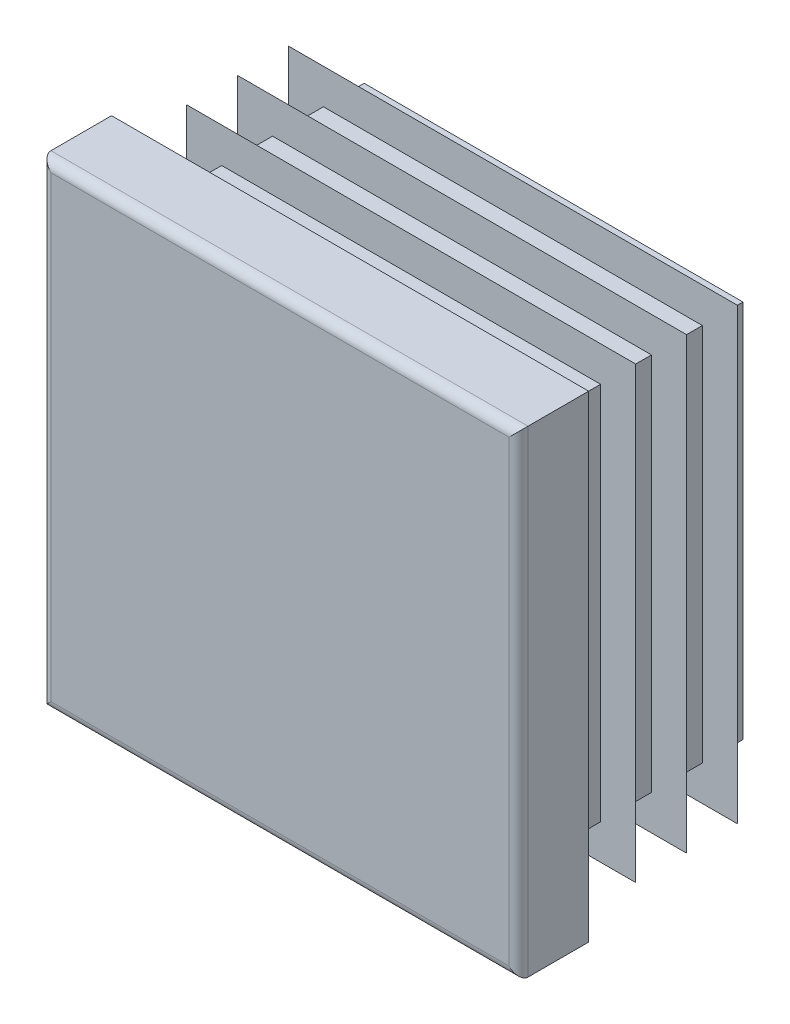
ISO-10303-21;
HEADER;
FILE_DESCRIPTION(('STEP AP214'),'2;1');
FILE_NAME('part.step','',(''),(''),'','','');
FILE_SCHEMA(('AUTOMOTIVE_DESIGN { 1 0 10303 214 1 1 1 1 }'));
ENDSEC;
DATA;
#1=APPLICATION_CONTEXT('core data for automotive mechanical design processes');
#2=APPLICATION_PROTOCOL_DEFINITION('international standard','automotive_design',2000,#1);
#3=PRODUCT_CONTEXT('',#1,'mechanical');
#4=PRODUCT('Part','Part','',(#3));
#5=PRODUCT_RELATED_PRODUCT_CATEGORY('part','',(#4));
#6=PRODUCT_DEFINITION_FORMATION('','',#4);
#7=PRODUCT_DEFINITION_CONTEXT('part definition',#1,'design');
#8=PRODUCT_DEFINITION('design','',#6,#7);
#9=PRODUCT_DEFINITION_SHAPE('','',#8);
#10=(LENGTH_UNIT() NAMED_UNIT(*) SI_UNIT(.MILLI.,.METRE.));
#11=(NAMED_UNIT(*) PLANE_ANGLE_UNIT() SI_UNIT($,.RADIAN.));
#12=(NAMED_UNIT(*) SI_UNIT($,.STERADIAN.) SOLID_ANGLE_UNIT());
#13=UNCERTAINTY_MEASURE_WITH_UNIT(LENGTH_MEASURE(1.E-05),#10,'distance_accuracy_value','');
#14=(GEOMETRIC_REPRESENTATION_CONTEXT(3) GLOBAL_UNCERTAINTY_ASSIGNED_CONTEXT((#13)) GLOBAL_UNIT_ASSIGNED_CONTEXT((#10,
#11,#12)) REPRESENTATION_CONTEXT('',''));
#15=CARTESIAN_POINT('',(0.,0.,0.));
#16=DIRECTION('',(0.,0.,1.));
#17=DIRECTION('',(1.,0.,0.));
#18=AXIS2_PLACEMENT_3D('',#15,#16,#17);
#19=CARTESIAN_POINT('',(16.32,-17.,5.));
#20=DIRECTION('',(0.,0.,-1.));
#21=DIRECTION('',(0.,1.,0.));
#22=AXIS2_PLACEMENT_3D('',#19,#20,#21);
#23=PLANE('',#22);
#24=DIRECTION('',(0.,1.,0.));
#25=VECTOR('',#24,1.);
#26=CARTESIAN_POINT('',(-16.32,-17.,5.));
#27=LINE('',#26,#25);
#28=CARTESIAN_POINT('',(-16.32,-16.32,5.));
#29=VERTEX_POINT('',#28);
#30=CARTESIAN_POINT('',(-16.32,16.32,5.));
#31=VERTEX_POINT('',#30);
#32=EDGE_CURVE('E262',#29,#31,#27,.T.);
#33=ORIENTED_EDGE('',*,*,#32,.F.);
#34=DIRECTION('',(-1.,0.,0.));
#35=VECTOR('',#34,1.);
#36=CARTESIAN_POINT('',(17.,-16.32,5.));
#37=LINE('',#36,#35);
#38=CARTESIAN_POINT('',(16.32,-16.32,5.));
#39=VERTEX_POINT('',#38);
#40=EDGE_CURVE('E432',#39,#29,#37,.T.);
#41=ORIENTED_EDGE('',*,*,#40,.F.);
#42=DIRECTION('',(0.,1.,0.));
#43=VECTOR('',#42,1.);
#44=CARTESIAN_POINT('',(16.32,-17.,5.));
#45=LINE('',#44,#43);
#46=CARTESIAN_POINT('',(16.32,16.32,5.));
#47=VERTEX_POINT('',#46);
#48=EDGE_CURVE('E257',#39,#47,#45,.T.);
#49=ORIENTED_EDGE('',*,*,#48,.T.);
#50=DIRECTION('',(-1.,0.,0.));
#51=VECTOR('',#50,1.);
#52=CARTESIAN_POINT('',(17.,16.32,5.));
#53=LINE('',#52,#51);
#54=EDGE_CURVE('E534',#47,#31,#53,.T.);
#55=ORIENTED_EDGE('',*,*,#54,.T.);
#56=EDGE_LOOP('',(#33,#41,#49,#55));
#57=FACE_BOUND('',#56,.T.);
#58=ADVANCED_FACE('F14',(#57),#23,.F.);
#59=CARTESIAN_POINT('',(-16.32,-17.,4.32));
#60=DIRECTION('',(0.,1.,0.));
#61=DIRECTION('',(-1.,0.,0.));
#62=AXIS2_PLACEMENT_3D('',#59,#60,#61);
#63=CYLINDRICAL_SURFACE('',#62,0.68);
#64=DIRECTION('',(0.,1.,0.));
#65=VECTOR('',#64,1.);
#66=CARTESIAN_POINT('',(-17.,-17.,4.32));
#67=LINE('',#66,#65);
#68=CARTESIAN_POINT('',(-17.,-17.,4.32));
#69=VERTEX_POINT('',#68);
#70=CARTESIAN_POINT('',(-17.,17.,4.32));
#71=VERTEX_POINT('',#70);
#72=EDGE_CURVE('E354',#69,#71,#67,.T.);
#73=ORIENTED_EDGE('',*,*,#72,.F.);
#74=CARTESIAN_POINT('',(-16.32,-16.32,4.32));
#75=DIRECTION('',(-0.707106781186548,0.707106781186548,0.));
#76=DIRECTION('',(0.707106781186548,0.707106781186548,0.));
#77=AXIS2_PLACEMENT_3D('',#74,#75,#76);
#78=ELLIPSE('',#77,0.961665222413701,0.68);
#79=EDGE_CURVE('E59',#69,#29,#78,.T.);
#80=ORIENTED_EDGE('',*,*,#79,.T.);
#81=ORIENTED_EDGE('',*,*,#32,.T.);
#82=CARTESIAN_POINT('',(-16.32,16.32,4.32));
#83=DIRECTION('',(0.707106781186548,0.707106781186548,0.));
#84=DIRECTION('',(-0.707106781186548,0.707106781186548,0.));
#85=AXIS2_PLACEMENT_3D('',#82,#83,#84);
#86=ELLIPSE('',#85,0.961665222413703,0.68);
#87=EDGE_CURVE('E258',#31,#71,#86,.F.);
#88=ORIENTED_EDGE('',*,*,#87,.T.);
#89=EDGE_LOOP('',(#73,#80,#81,#88));
#90=FACE_BOUND('',#89,.T.);
#91=ADVANCED_FACE('F16',(#90),#63,.T.);
#92=CARTESIAN_POINT('',(-17.,-17.,4.32));
#93=DIRECTION('',(1.,0.,0.));
#94=DIRECTION('',(0.,1.,0.));
#95=AXIS2_PLACEMENT_3D('',#92,#93,#94);
#96=PLANE('',#95);
#97=DIRECTION('',(0.,0.,-1.));
#98=VECTOR('',#97,1.);
#99=CARTESIAN_POINT('',(-17.,17.,4.32));
#100=LINE('',#99,#98);
#101=CARTESIAN_POINT('',(-17.,17.,0.));
#102=VERTEX_POINT('',#101);
#103=EDGE_CURVE('E519',#71,#102,#100,.T.);
#104=ORIENTED_EDGE('',*,*,#103,.T.);
#105=DIRECTION('',(0.,1.,0.));
#106=VECTOR('',#105,1.);
#107=CARTESIAN_POINT('',(-17.,-17.,0.));
#108=LINE('',#107,#106);
#109=CARTESIAN_POINT('',(-17.,-17.,0.));
#110=VERTEX_POINT('',#109);
#111=EDGE_CURVE('E352',#110,#102,#108,.T.);
#112=ORIENTED_EDGE('',*,*,#111,.F.);
#113=DIRECTION('',(0.,0.,-1.));
#114=VECTOR('',#113,1.);
#115=CARTESIAN_POINT('',(-17.,-17.,4.32));
#116=LINE('',#115,#114);
#117=EDGE_CURVE('E520',#69,#110,#116,.T.);
#118=ORIENTED_EDGE('',*,*,#117,.F.);
#119=ORIENTED_EDGE('',*,*,#72,.T.);
#120=EDGE_LOOP('',(#104,#112,#118,#119));
#121=FACE_BOUND('',#120,.T.);
#122=ADVANCED_FACE('F604',(#121),#96,.F.);
#123=CARTESIAN_POINT('',(-13.5,-17.,0.));
#124=DIRECTION('',(1.,0.,0.));
#125=DIRECTION('',(0.,1.,0.));
#126=AXIS2_PLACEMENT_3D('',#123,#124,#125);
#127=PLANE('',#126);
#128=DIRECTION('',(0.,1.,0.));
#129=VECTOR('',#128,1.);
#130=CARTESIAN_POINT('',(-13.5,-17.,0.));
#131=LINE('',#130,#129);
#132=CARTESIAN_POINT('',(-13.5,-13.5,0.));
#133=VERTEX_POINT('',#132);
#134=CARTESIAN_POINT('',(-13.5,13.5,0.));
#135=VERTEX_POINT('',#134);
#136=EDGE_CURVE('E349',#133,#135,#131,.T.);
#137=ORIENTED_EDGE('',*,*,#136,.T.);
#138=DIRECTION('',(0.,0.,-1.));
#139=VECTOR('',#138,1.);
#140=CARTESIAN_POINT('',(-13.5,13.5,0.));
#141=LINE('',#140,#139);
#142=CARTESIAN_POINT('',(-13.5,13.5,-0.725));
#143=VERTEX_POINT('',#142);
#144=EDGE_CURVE('E445',#135,#143,#141,.T.);
#145=ORIENTED_EDGE('',*,*,#144,.T.);
#146=DIRECTION('',(0.,1.,0.));
#147=VECTOR('',#146,1.);
#148=CARTESIAN_POINT('',(-13.5,-17.,-0.725));
#149=LINE('',#148,#147);
#150=CARTESIAN_POINT('',(-13.5,-13.5,-0.725));
#151=VERTEX_POINT('',#150);
#152=EDGE_CURVE('E346',#151,#143,#149,.T.);
#153=ORIENTED_EDGE('',*,*,#152,.F.);
#154=DIRECTION('',(0.,0.,1.));
#155=VECTOR('',#154,1.);
#156=CARTESIAN_POINT('',(-13.5,-13.5,0.));
#157=LINE('',#156,#155);
#158=EDGE_CURVE('E439',#151,#133,#157,.T.);
#159=ORIENTED_EDGE('',*,*,#158,.T.);
#160=EDGE_LOOP('',(#137,#145,#153,#159));
#161=FACE_BOUND('',#160,.T.);
#162=ADVANCED_FACE('F728',(#161),#127,.F.);
#163=CARTESIAN_POINT('',(-16.,-17.,-0.725));
#164=DIRECTION('',(0.573576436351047,0.,0.819152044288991));
#165=DIRECTION('',(-0.819152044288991,0.,0.573576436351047));
#166=AXIS2_PLACEMENT_3D('',#163,#164,#165);
#167=PLANE('',#166);
#168=DIRECTION('',(0.,1.,0.));
#169=VECTOR('',#168,1.);
#170=CARTESIAN_POINT('',(-16.,-17.,-0.725));
#171=LINE('',#170,#169);
#172=CARTESIAN_POINT('',(-16.,-16.,-0.725));
#173=VERTEX_POINT('',#172);
#174=CARTESIAN_POINT('',(-16.,16.,-0.725));
#175=VERTEX_POINT('',#174);
#176=EDGE_CURVE('E344',#173,#175,#171,.T.);
#177=ORIENTED_EDGE('',*,*,#176,.T.);
#178=DIRECTION('',(0.633687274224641,-0.633687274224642,-0.443712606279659));
#179=VECTOR('',#178,1.);
#180=CARTESIAN_POINT('',(-2.74853447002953,2.74853447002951,-10.0037760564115));
#181=LINE('',#180,#179);
#182=CARTESIAN_POINT('',(-13.5,13.5,-2.47551884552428));
#183=VERTEX_POINT('',#182);
#184=EDGE_CURVE('E457',#175,#183,#181,.T.);
#185=ORIENTED_EDGE('',*,*,#184,.T.);
#186=DIRECTION('',(0.,1.,0.));
#187=VECTOR('',#186,1.);
#188=CARTESIAN_POINT('',(-13.5,-17.,-2.47551884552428));
#189=LINE('',#188,#187);
#190=CARTESIAN_POINT('',(-13.5,-13.5,-2.47551884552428));
#191=VERTEX_POINT('',#190);
#192=EDGE_CURVE('E341',#191,#183,#189,.T.);
#193=ORIENTED_EDGE('',*,*,#192,.F.);
#194=DIRECTION('',(-0.633687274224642,-0.633687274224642,0.443712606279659));
#195=VECTOR('',#194,1.);
#196=CARTESIAN_POINT('',(-16.4015595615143,-16.4015595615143,-0.443824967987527));
#197=LINE('',#196,#195);
#198=EDGE_CURVE('E451',#191,#173,#197,.T.);
#199=ORIENTED_EDGE('',*,*,#198,.T.);
#200=EDGE_LOOP('',(#177,#185,#193,#199));
#201=FACE_BOUND('',#200,.T.);
#202=ADVANCED_FACE('F732',(#201),#167,.F.);
#203=CARTESIAN_POINT('',(-13.5,-17.,-2.47551884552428));
#204=DIRECTION('',(1.,0.,0.));
#205=DIRECTION('',(0.,1.,0.));
#206=AXIS2_PLACEMENT_3D('',#203,#204,#205);
#207=PLANE('',#206);
#208=ORIENTED_EDGE('',*,*,#192,.T.);
#209=DIRECTION('',(0.,0.,-1.));
#210=VECTOR('',#209,1.);
#211=CARTESIAN_POINT('',(-13.5,13.5,-2.47551884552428));
#212=LINE('',#211,#210);
#213=CARTESIAN_POINT('',(-13.5,13.5,-4.35));
#214=VERTEX_POINT('',#213);
#215=EDGE_CURVE('E463',#183,#214,#212,.T.);
#216=ORIENTED_EDGE('',*,*,#215,.T.);
#217=DIRECTION('',(0.,1.,0.));
#218=VECTOR('',#217,1.);
#219=CARTESIAN_POINT('',(-13.5,-17.,-4.35));
#220=LINE('',#219,#218);
#221=CARTESIAN_POINT('',(-13.5,-13.5,-4.35));
#222=VERTEX_POINT('',#221);
#223=EDGE_CURVE('E338',#222,#214,#220,.T.);
#224=ORIENTED_EDGE('',*,*,#223,.F.);
#225=DIRECTION('',(0.,0.,1.));
#226=VECTOR('',#225,1.);
#227=CARTESIAN_POINT('',(-13.5,-13.5,-2.47551884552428));
#228=LINE('',#227,#226);
#229=EDGE_CURVE('E460',#222,#191,#228,.T.);
#230=ORIENTED_EDGE('',*,*,#229,.T.);
#231=EDGE_LOOP('',(#208,#216,#224,#230));
#232=FACE_BOUND('',#231,.T.);
#233=ADVANCED_FACE('F738',(#232),#207,.F.);
#234=CARTESIAN_POINT('',(-16.,-17.,-4.35));
#235=DIRECTION('',(0.573576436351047,0.,0.819152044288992));
#236=DIRECTION('',(-0.819152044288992,0.,0.573576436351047));
#237=AXIS2_PLACEMENT_3D('',#234,#235,#236);
#238=PLANE('',#237);
#239=DIRECTION('',(0.,1.,0.));
#240=VECTOR('',#239,1.);
#241=CARTESIAN_POINT('',(-16.,-17.,-4.35));
#242=LINE('',#241,#240);
#243=CARTESIAN_POINT('',(-16.,-16.,-4.35));
#244=VERTEX_POINT('',#243);
#245=CARTESIAN_POINT('',(-16.,16.,-4.35));
#246=VERTEX_POINT('',#245);
#247=EDGE_CURVE('E336',#244,#246,#242,.T.);
#248=ORIENTED_EDGE('',*,*,#247,.T.);
#249=DIRECTION('',(0.633687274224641,-0.633687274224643,-0.443712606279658));
#250=VECTOR('',#249,1.);
#251=CARTESIAN_POINT('',(-2.74853447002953,2.7485344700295,-13.6287760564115));
#252=LINE('',#251,#250);
#253=CARTESIAN_POINT('',(-13.5,13.5,-6.10051884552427));
#254=VERTEX_POINT('',#253);
#255=EDGE_CURVE('E475',#246,#254,#252,.T.);
#256=ORIENTED_EDGE('',*,*,#255,.T.);
#257=DIRECTION('',(0.,1.,0.));
#258=VECTOR('',#257,1.);
#259=CARTESIAN_POINT('',(-13.5,-17.,-6.10051884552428));
#260=LINE('',#259,#258);
#261=CARTESIAN_POINT('',(-13.5,-13.5,-6.10051884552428));
#262=VERTEX_POINT('',#261);
#263=EDGE_CURVE('E333',#262,#254,#260,.T.);
#264=ORIENTED_EDGE('',*,*,#263,.F.);
#265=DIRECTION('',(-0.633687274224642,-0.633687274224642,0.443712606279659));
#266=VECTOR('',#265,1.);
#267=CARTESIAN_POINT('',(-16.4015595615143,-16.4015595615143,-4.06882496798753));
#268=LINE('',#267,#266);
#269=EDGE_CURVE('E469',#262,#244,#268,.T.);
#270=ORIENTED_EDGE('',*,*,#269,.T.);
#271=EDGE_LOOP('',(#248,#256,#264,#270));
#272=FACE_BOUND('',#271,.T.);
#273=ADVANCED_FACE('F742',(#272),#238,.F.);
#274=CARTESIAN_POINT('',(-13.5,-17.,-6.10051884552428));
#275=DIRECTION('',(1.,0.,0.));
#276=DIRECTION('',(0.,1.,0.));
#277=AXIS2_PLACEMENT_3D('',#274,#275,#276);
#278=PLANE('',#277);
#279=ORIENTED_EDGE('',*,*,#263,.T.);
#280=DIRECTION('',(0.,0.,-1.));
#281=VECTOR('',#280,1.);
#282=CARTESIAN_POINT('',(-13.5,13.5,-6.10051884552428));
#283=LINE('',#282,#281);
#284=CARTESIAN_POINT('',(-13.5,13.5,-7.975));
#285=VERTEX_POINT('',#284);
#286=EDGE_CURVE('E481',#254,#285,#283,.T.);
#287=ORIENTED_EDGE('',*,*,#286,.T.);
#288=DIRECTION('',(0.,1.,0.));
#289=VECTOR('',#288,1.);
#290=CARTESIAN_POINT('',(-13.5,-17.,-7.975));
#291=LINE('',#290,#289);
#292=CARTESIAN_POINT('',(-13.5,-13.5,-7.975));
#293=VERTEX_POINT('',#292);
#294=EDGE_CURVE('E330',#293,#285,#291,.T.);
#295=ORIENTED_EDGE('',*,*,#294,.F.);
#296=DIRECTION('',(0.,0.,1.));
#297=VECTOR('',#296,1.);
#298=CARTESIAN_POINT('',(-13.5,-13.5,-6.10051884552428));
#299=LINE('',#298,#297);
#300=EDGE_CURVE('E478',#293,#262,#299,.T.);
#301=ORIENTED_EDGE('',*,*,#300,.T.);
#302=EDGE_LOOP('',(#279,#287,#295,#301));
#303=FACE_BOUND('',#302,.T.);
#304=ADVANCED_FACE('F746',(#303),#278,.F.);
#305=CARTESIAN_POINT('',(-16.,-17.,-7.975));
#306=DIRECTION('',(0.573576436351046,0.,0.819152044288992));
#307=DIRECTION('',(-0.819152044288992,0.,0.573576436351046));
#308=AXIS2_PLACEMENT_3D('',#305,#306,#307);
#309=PLANE('',#308);
#310=DIRECTION('',(0.,1.,0.));
#311=VECTOR('',#310,1.);
#312=CARTESIAN_POINT('',(-16.,-17.,-7.975));
#313=LINE('',#312,#311);
#314=CARTESIAN_POINT('',(-16.,-16.,-7.975));
#315=VERTEX_POINT('',#314);
#316=CARTESIAN_POINT('',(-16.,16.,-7.975));
#317=VERTEX_POINT('',#316);
#318=EDGE_CURVE('E328',#315,#317,#313,.T.);
#319=ORIENTED_EDGE('',*,*,#318,.T.);
#320=DIRECTION('',(0.633687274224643,-0.633687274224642,-0.443712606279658));
#321=VECTOR('',#320,1.);
#322=CARTESIAN_POINT('',(-2.74853447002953,2.74853447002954,-17.2537760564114));
#323=LINE('',#322,#321);
#324=CARTESIAN_POINT('',(-13.5,13.5,-9.72551884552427));
#325=VERTEX_POINT('',#324);
#326=EDGE_CURVE('E493',#317,#325,#323,.T.);
#327=ORIENTED_EDGE('',*,*,#326,.T.);
#328=DIRECTION('',(0.,1.,0.));
#329=VECTOR('',#328,1.);
#330=CARTESIAN_POINT('',(-13.5,-17.,-9.72551884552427));
#331=LINE('',#330,#329);
#332=CARTESIAN_POINT('',(-13.5,-13.5,-9.72551884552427));
#333=VERTEX_POINT('',#332);
#334=EDGE_CURVE('E325',#333,#325,#331,.T.);
#335=ORIENTED_EDGE('',*,*,#334,.F.);
#336=DIRECTION('',(-0.633687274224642,-0.633687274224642,0.443712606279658));
#337=VECTOR('',#336,1.);
#338=CARTESIAN_POINT('',(-16.4015595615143,-16.4015595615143,-7.69382496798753));
#339=LINE('',#338,#337);
#340=EDGE_CURVE('E487',#333,#315,#339,.T.);
#341=ORIENTED_EDGE('',*,*,#340,.T.);
#342=EDGE_LOOP('',(#319,#327,#335,#341));
#343=FACE_BOUND('',#342,.T.);
#344=ADVANCED_FACE('F668',(#343),#309,.F.);
#345=CARTESIAN_POINT('',(-13.5,-17.,-9.72551884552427));
#346=DIRECTION('',(1.,0.,0.));
#347=DIRECTION('',(0.,1.,0.));
#348=AXIS2_PLACEMENT_3D('',#345,#346,#347);
#349=PLANE('',#348);
#350=ORIENTED_EDGE('',*,*,#334,.T.);
#351=DIRECTION('',(0.,0.,-1.));
#352=VECTOR('',#351,1.);
#353=CARTESIAN_POINT('',(-13.5,13.5,-9.72551884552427));
#354=LINE('',#353,#352);
#355=CARTESIAN_POINT('',(-13.5,13.5,-11.6));
#356=VERTEX_POINT('',#355);
#357=EDGE_CURVE('E499',#325,#356,#354,.T.);
#358=ORIENTED_EDGE('',*,*,#357,.T.);
#359=DIRECTION('',(0.,1.,0.));
#360=VECTOR('',#359,1.);
#361=CARTESIAN_POINT('',(-13.5,-17.,-11.6));
#362=LINE('',#361,#360);
#363=CARTESIAN_POINT('',(-13.5,-13.5,-11.6));
#364=VERTEX_POINT('',#363);
#365=EDGE_CURVE('E322',#364,#356,#362,.T.);
#366=ORIENTED_EDGE('',*,*,#365,.F.);
#367=DIRECTION('',(0.,0.,1.));
#368=VECTOR('',#367,1.);
#369=CARTESIAN_POINT('',(-13.5,-13.5,-9.72551884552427));
#370=LINE('',#369,#368);
#371=EDGE_CURVE('E496',#364,#333,#370,.T.);
#372=ORIENTED_EDGE('',*,*,#371,.T.);
#373=EDGE_LOOP('',(#350,#358,#366,#372));
#374=FACE_BOUND('',#373,.T.);
#375=ADVANCED_FACE('F665',(#374),#349,.F.);
#376=CARTESIAN_POINT('',(-16.,-17.,-11.6));
#377=DIRECTION('',(0.573576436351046,0.,0.819152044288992));
#378=DIRECTION('',(-0.819152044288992,0.,0.573576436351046));
#379=AXIS2_PLACEMENT_3D('',#376,#377,#378);
#380=PLANE('',#379);
#381=DIRECTION('',(0.,1.,0.));
#382=VECTOR('',#381,1.);
#383=CARTESIAN_POINT('',(-16.,-17.,-11.6));
#384=LINE('',#383,#382);
#385=CARTESIAN_POINT('',(-16.,-16.,-11.6));
#386=VERTEX_POINT('',#385);
#387=CARTESIAN_POINT('',(-16.,16.,-11.6));
#388=VERTEX_POINT('',#387);
#389=EDGE_CURVE('E320',#386,#388,#384,.T.);
#390=ORIENTED_EDGE('',*,*,#389,.T.);
#391=DIRECTION('',(0.633687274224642,-0.633687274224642,-0.443712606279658));
#392=VECTOR('',#391,1.);
#393=CARTESIAN_POINT('',(-2.74853447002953,2.74853447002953,-20.8787760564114));
#394=LINE('',#393,#392);
#395=CARTESIAN_POINT('',(-13.5,13.5,-13.3505188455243));
#396=VERTEX_POINT('',#395);
#397=EDGE_CURVE('E511',#388,#396,#394,.T.);
#398=ORIENTED_EDGE('',*,*,#397,.T.);
#399=DIRECTION('',(0.,1.,0.));
#400=VECTOR('',#399,1.);
#401=CARTESIAN_POINT('',(-13.5,-17.,-13.3505188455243));
#402=LINE('',#401,#400);
#403=CARTESIAN_POINT('',(-13.5,-13.5,-13.3505188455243));
#404=VERTEX_POINT('',#403);
#405=EDGE_CURVE('E317',#404,#396,#402,.T.);
#406=ORIENTED_EDGE('',*,*,#405,.F.);
#407=DIRECTION('',(-0.633687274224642,-0.633687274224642,0.443712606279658));
#408=VECTOR('',#407,1.);
#409=CARTESIAN_POINT('',(-16.4015595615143,-16.4015595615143,-11.3188249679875));
#410=LINE('',#409,#408);
#411=EDGE_CURVE('E505',#404,#386,#410,.T.);
#412=ORIENTED_EDGE('',*,*,#411,.T.);
#413=EDGE_LOOP('',(#390,#398,#406,#412));
#414=FACE_BOUND('',#413,.T.);
#415=ADVANCED_FACE('F580',(#414),#380,.F.);
#416=CARTESIAN_POINT('',(-13.5,-17.,-13.3505188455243));
#417=DIRECTION('',(1.,0.,0.));
#418=DIRECTION('',(0.,1.,0.));
#419=AXIS2_PLACEMENT_3D('',#416,#417,#418);
#420=PLANE('',#419);
#421=ORIENTED_EDGE('',*,*,#405,.T.);
#422=DIRECTION('',(0.,0.,-1.));
#423=VECTOR('',#422,1.);
#424=CARTESIAN_POINT('',(-13.5,13.5,-13.3505188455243));
#425=LINE('',#424,#423);
#426=CARTESIAN_POINT('',(-13.5,13.5,-14.5));
#427=VERTEX_POINT('',#426);
#428=EDGE_CURVE('E517',#396,#427,#425,.T.);
#429=ORIENTED_EDGE('',*,*,#428,.T.);
#430=DIRECTION('',(0.,1.,0.));
#431=VECTOR('',#430,1.);
#432=CARTESIAN_POINT('',(-13.5,-17.,-14.5));
#433=LINE('',#432,#431);
#434=CARTESIAN_POINT('',(-13.5,-13.5,-14.5));
#435=VERTEX_POINT('',#434);
#436=EDGE_CURVE('E314',#435,#427,#433,.T.);
#437=ORIENTED_EDGE('',*,*,#436,.F.);
#438=DIRECTION('',(0.,0.,1.));
#439=VECTOR('',#438,1.);
#440=CARTESIAN_POINT('',(-13.5,-13.5,-13.3505188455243));
#441=LINE('',#440,#439);
#442=EDGE_CURVE('E514',#435,#404,#441,.T.);
#443=ORIENTED_EDGE('',*,*,#442,.T.);
#444=EDGE_LOOP('',(#421,#429,#437,#443));
#445=FACE_BOUND('',#444,.T.);
#446=ADVANCED_FACE('F582',(#445),#420,.F.);
#447=CARTESIAN_POINT('',(-13.5,-17.,-14.5));
#448=DIRECTION('',(0.,0.,1.));
#449=DIRECTION('',(0.,-1.,0.));
#450=AXIS2_PLACEMENT_3D('',#447,#448,#449);
#451=PLANE('',#450);
#452=ORIENTED_EDGE('',*,*,#436,.T.);
#453=DIRECTION('',(-1.,0.,0.));
#454=VECTOR('',#453,1.);
#455=CARTESIAN_POINT('',(17.,13.5,-14.5));
#456=LINE('',#455,#454);
#457=CARTESIAN_POINT('',(13.5,13.5,-14.5));
#458=VERTEX_POINT('',#457);
#459=EDGE_CURVE('E388',#458,#427,#456,.T.);
#460=ORIENTED_EDGE('',*,*,#459,.F.);
#461=DIRECTION('',(0.,1.,0.));
#462=VECTOR('',#461,1.);
#463=CARTESIAN_POINT('',(13.5,-17.,-14.5));
#464=LINE('',#463,#462);
#465=CARTESIAN_POINT('',(13.5,-13.5,-14.5));
#466=VERTEX_POINT('',#465);
#467=EDGE_CURVE('E311',#466,#458,#464,.T.);
#468=ORIENTED_EDGE('',*,*,#467,.F.);
#469=DIRECTION('',(-1.,0.,0.));
#470=VECTOR('',#469,1.);
#471=CARTESIAN_POINT('',(17.,-13.5,-14.5));
#472=LINE('',#471,#470);
#473=EDGE_CURVE('E386',#466,#435,#472,.T.);
#474=ORIENTED_EDGE('',*,*,#473,.T.);
#475=EDGE_LOOP('',(#452,#460,#468,#474));
#476=FACE_BOUND('',#475,.T.);
#477=ADVANCED_FACE('F385',(#476),#451,.F.);
#478=CARTESIAN_POINT('',(13.5,-17.,-14.5));
#479=DIRECTION('',(-1.,0.,0.));
#480=DIRECTION('',(0.,-1.,0.));
#481=AXIS2_PLACEMENT_3D('',#478,#479,#480);
#482=PLANE('',#481);
#483=ORIENTED_EDGE('',*,*,#467,.T.);
#484=DIRECTION('',(0.,0.,1.));
#485=VECTOR('',#484,1.);
#486=CARTESIAN_POINT('',(13.5,13.5,-14.5));
#487=LINE('',#486,#485);
#488=CARTESIAN_POINT('',(13.5,13.5,-13.3505188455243));
#489=VERTEX_POINT('',#488);
#490=EDGE_CURVE('E9',#458,#489,#487,.T.);
#491=ORIENTED_EDGE('',*,*,#490,.T.);
#492=DIRECTION('',(0.,1.,0.));
#493=VECTOR('',#492,1.);
#494=CARTESIAN_POINT('',(13.5,-17.,-13.3505188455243));
#495=LINE('',#494,#493);
#496=CARTESIAN_POINT('',(13.5,-13.5,-13.3505188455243));
#497=VERTEX_POINT('',#496);
#498=EDGE_CURVE('E308',#497,#489,#495,.T.);
#499=ORIENTED_EDGE('',*,*,#498,.F.);
#500=DIRECTION('',(0.,0.,-1.));
#501=VECTOR('',#500,1.);
#502=CARTESIAN_POINT('',(13.5,-13.5,-14.5));
#503=LINE('',#502,#501);
#504=EDGE_CURVE('E23',#497,#466,#503,.T.);
#505=ORIENTED_EDGE('',*,*,#504,.T.);
#506=EDGE_LOOP('',(#483,#491,#499,#505));
#507=FACE_BOUND('',#506,.T.);
#508=ADVANCED_FACE('F378',(#507),#482,.F.);
#509=CARTESIAN_POINT('',(13.5,-17.,-13.3505188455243));
#510=DIRECTION('',(-0.573576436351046,0.,0.819152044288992));
#511=DIRECTION('',(-0.819152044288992,0.,-0.573576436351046));
#512=AXIS2_PLACEMENT_3D('',#509,#510,#511);
#513=PLANE('',#512);
#514=ORIENTED_EDGE('',*,*,#498,.T.);
#515=DIRECTION('',(0.633687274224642,0.633687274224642,0.443712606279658));
#516=VECTOR('',#515,1.);
#517=CARTESIAN_POINT('',(1.25243337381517,1.25243337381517,-21.9263573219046));
#518=LINE('',#517,#516);
#519=CARTESIAN_POINT('',(16.,16.,-11.6));
#520=VERTEX_POINT('',#519);
#521=EDGE_CURVE('E508',#489,#520,#518,.T.);
#522=ORIENTED_EDGE('',*,*,#521,.T.);
#523=DIRECTION('',(0.,1.,0.));
#524=VECTOR('',#523,1.);
#525=CARTESIAN_POINT('',(16.,-17.,-11.6));
#526=LINE('',#525,#524);
#527=CARTESIAN_POINT('',(16.,-16.,-11.6));
#528=VERTEX_POINT('',#527);
#529=EDGE_CURVE('E305',#528,#520,#526,.T.);
#530=ORIENTED_EDGE('',*,*,#529,.F.);
#531=DIRECTION('',(-0.633687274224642,0.633687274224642,-0.443712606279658));
#532=VECTOR('',#531,1.);
#533=CARTESIAN_POINT('',(14.9054584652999,-14.9054584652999,-12.3664062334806));
#534=LINE('',#533,#532);
#535=EDGE_CURVE('E502',#528,#497,#534,.T.);
#536=ORIENTED_EDGE('',*,*,#535,.T.);
#537=EDGE_LOOP('',(#514,#522,#530,#536));
#538=FACE_BOUND('',#537,.T.);
#539=ADVANCED_FACE('F588',(#538),#513,.F.);
#540=CARTESIAN_POINT('',(16.,-17.,-11.6));
#541=DIRECTION('',(0.,0.,-1.));
#542=DIRECTION('',(0.,1.,0.));
#543=AXIS2_PLACEMENT_3D('',#540,#541,#542);
#544=PLANE('',#543);
#545=ORIENTED_EDGE('',*,*,#529,.T.);
#546=DIRECTION('',(-1.,0.,0.));
#547=VECTOR('',#546,1.);
#548=CARTESIAN_POINT('',(17.,16.,-11.6));
#549=LINE('',#548,#547);
#550=EDGE_CURVE('E394',#520,#388,#549,.T.);
#551=ORIENTED_EDGE('',*,*,#550,.T.);
#552=ORIENTED_EDGE('',*,*,#389,.F.);
#553=DIRECTION('',(-1.,0.,0.));
#554=VECTOR('',#553,1.);
#555=CARTESIAN_POINT('',(17.,-16.,-11.6));
#556=LINE('',#555,#554);
#557=EDGE_CURVE('E401',#528,#386,#556,.T.);
#558=ORIENTED_EDGE('',*,*,#557,.F.);
#559=EDGE_LOOP('',(#545,#551,#552,#558));
#560=FACE_BOUND('',#559,.T.);
#561=ORIENTED_EDGE('',*,*,#365,.T.);
#562=DIRECTION('',(-1.,0.,0.));
#563=VECTOR('',#562,1.);
#564=CARTESIAN_POINT('',(17.,13.5,-11.6));
#565=LINE('',#564,#563);
#566=CARTESIAN_POINT('',(13.5,13.5,-11.6));
#567=VERTEX_POINT('',#566);
#568=EDGE_CURVE('E567',#567,#356,#565,.T.);
#569=ORIENTED_EDGE('',*,*,#568,.F.);
#570=DIRECTION('',(0.,1.,0.));
#571=VECTOR('',#570,1.);
#572=CARTESIAN_POINT('',(13.5,-17.,-11.6));
#573=LINE('',#572,#571);
#574=CARTESIAN_POINT('',(13.5,-13.5,-11.6));
#575=VERTEX_POINT('',#574);
#576=EDGE_CURVE('E302',#575,#567,#573,.T.);
#577=ORIENTED_EDGE('',*,*,#576,.F.);
#578=DIRECTION('',(-1.,0.,0.));
#579=VECTOR('',#578,1.);
#580=CARTESIAN_POINT('',(17.,-13.5,-11.6));
#581=LINE('',#580,#579);
#582=EDGE_CURVE('E403',#575,#364,#581,.T.);
#583=ORIENTED_EDGE('',*,*,#582,.T.);
#584=EDGE_LOOP('',(#561,#569,#577,#583));
#585=FACE_BOUND('',#584,.T.);
#586=ADVANCED_FACE('F571',(#560,#585),#544,.F.);
#587=CARTESIAN_POINT('',(13.5,-17.,-11.6));
#588=DIRECTION('',(-1.,0.,0.));
#589=DIRECTION('',(0.,-1.,0.));
#590=AXIS2_PLACEMENT_3D('',#587,#588,#589);
#591=PLANE('',#590);
#592=ORIENTED_EDGE('',*,*,#576,.T.);
#593=DIRECTION('',(0.,0.,1.));
#594=VECTOR('',#593,1.);
#595=CARTESIAN_POINT('',(13.5,13.5,-11.6));
#596=LINE('',#595,#594);
#597=CARTESIAN_POINT('',(13.5,13.5,-9.72551884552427));
#598=VERTEX_POINT('',#597);
#599=EDGE_CURVE('E372',#567,#598,#596,.T.);
#600=ORIENTED_EDGE('',*,*,#599,.T.);
#601=DIRECTION('',(0.,1.,0.));
#602=VECTOR('',#601,1.);
#603=CARTESIAN_POINT('',(13.5,-17.,-9.72551884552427));
#604=LINE('',#603,#602);
#605=CARTESIAN_POINT('',(13.5,-13.5,-9.72551884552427));
#606=VERTEX_POINT('',#605);
#607=EDGE_CURVE('E299',#606,#598,#604,.T.);
#608=ORIENTED_EDGE('',*,*,#607,.F.);
#609=DIRECTION('',(0.,0.,-1.));
#610=VECTOR('',#609,1.);
#611=CARTESIAN_POINT('',(13.5,-13.5,-11.6));
#612=LINE('',#611,#610);
#613=EDGE_CURVE('E369',#606,#575,#612,.T.);
#614=ORIENTED_EDGE('',*,*,#613,.T.);
#615=EDGE_LOOP('',(#592,#600,#608,#614));
#616=FACE_BOUND('',#615,.T.);
#617=ADVANCED_FACE('F596',(#616),#591,.F.);
#618=CARTESIAN_POINT('',(13.5,-17.,-9.72551884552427));
#619=DIRECTION('',(-0.573576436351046,0.,0.819152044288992));
#620=DIRECTION('',(-0.819152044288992,0.,-0.573576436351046));
#621=AXIS2_PLACEMENT_3D('',#618,#619,#620);
#622=PLANE('',#621);
#623=ORIENTED_EDGE('',*,*,#607,.T.);
#624=DIRECTION('',(0.633687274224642,0.633687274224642,0.443712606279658));
#625=VECTOR('',#624,1.);
#626=CARTESIAN_POINT('',(1.25243337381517,1.25243337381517,-18.3013573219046));
#627=LINE('',#626,#625);
#628=CARTESIAN_POINT('',(16.,16.,-7.975));
#629=VERTEX_POINT('',#628);
#630=EDGE_CURVE('E490',#598,#629,#627,.T.);
#631=ORIENTED_EDGE('',*,*,#630,.T.);
#632=DIRECTION('',(0.,1.,0.));
#633=VECTOR('',#632,1.);
#634=CARTESIAN_POINT('',(16.,-17.,-7.975));
#635=LINE('',#634,#633);
#636=CARTESIAN_POINT('',(16.,-16.,-7.975));
#637=VERTEX_POINT('',#636);
#638=EDGE_CURVE('E296',#637,#629,#635,.T.);
#639=ORIENTED_EDGE('',*,*,#638,.F.);
#640=DIRECTION('',(-0.633687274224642,0.633687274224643,-0.443712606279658));
#641=VECTOR('',#640,1.);
#642=CARTESIAN_POINT('',(14.9054584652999,-14.9054584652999,-8.74140623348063));
#643=LINE('',#642,#641);
#644=EDGE_CURVE('E484',#637,#606,#643,.T.);
#645=ORIENTED_EDGE('',*,*,#644,.T.);
#646=EDGE_LOOP('',(#623,#631,#639,#645));
#647=FACE_BOUND('',#646,.T.);
#648=ADVANCED_FACE('F648',(#647),#622,.F.);
#649=CARTESIAN_POINT('',(16.,-17.,-7.975));
#650=DIRECTION('',(0.,0.,-1.));
#651=DIRECTION('',(0.,1.,0.));
#652=AXIS2_PLACEMENT_3D('',#649,#650,#651);
#653=PLANE('',#652);
#654=ORIENTED_EDGE('',*,*,#638,.T.);
#655=DIRECTION('',(-1.,0.,0.));
#656=VECTOR('',#655,1.);
#657=CARTESIAN_POINT('',(17.,16.,-7.975));
#658=LINE('',#657,#656);
#659=EDGE_CURVE('E561',#629,#317,#658,.T.);
#660=ORIENTED_EDGE('',*,*,#659,.T.);
#661=ORIENTED_EDGE('',*,*,#318,.F.);
#662=DIRECTION('',(-1.,0.,0.));
#663=VECTOR('',#662,1.);
#664=CARTESIAN_POINT('',(17.,-16.,-7.975));
#665=LINE('',#664,#663);
#666=EDGE_CURVE('E409',#637,#315,#665,.T.);
#667=ORIENTED_EDGE('',*,*,#666,.F.);
#668=EDGE_LOOP('',(#654,#660,#661,#667));
#669=FACE_BOUND('',#668,.T.);
#670=ORIENTED_EDGE('',*,*,#294,.T.);
#671=DIRECTION('',(-1.,0.,0.));
#672=VECTOR('',#671,1.);
#673=CARTESIAN_POINT('',(17.,13.5,-7.975));
#674=LINE('',#673,#672);
#675=CARTESIAN_POINT('',(13.5,13.5,-7.975));
#676=VERTEX_POINT('',#675);
#677=EDGE_CURVE('E559',#676,#285,#674,.T.);
#678=ORIENTED_EDGE('',*,*,#677,.F.);
#679=DIRECTION('',(0.,1.,0.));
#680=VECTOR('',#679,1.);
#681=CARTESIAN_POINT('',(13.5,-17.,-7.975));
#682=LINE('',#681,#680);
#683=CARTESIAN_POINT('',(13.5,-13.5,-7.975));
#684=VERTEX_POINT('',#683);
#685=EDGE_CURVE('E293',#684,#676,#682,.T.);
#686=ORIENTED_EDGE('',*,*,#685,.F.);
#687=DIRECTION('',(-1.,0.,0.));
#688=VECTOR('',#687,1.);
#689=CARTESIAN_POINT('',(17.,-13.5,-7.975));
#690=LINE('',#689,#688);
#691=EDGE_CURVE('E411',#684,#293,#690,.T.);
#692=ORIENTED_EDGE('',*,*,#691,.T.);
#693=EDGE_LOOP('',(#670,#678,#686,#692));
#694=FACE_BOUND('',#693,.T.);
#695=ADVANCED_FACE('F644',(#669,#694),#653,.F.);
#696=CARTESIAN_POINT('',(13.5,-17.,-7.975));
#697=DIRECTION('',(-1.,0.,0.));
#698=DIRECTION('',(0.,-1.,0.));
#699=AXIS2_PLACEMENT_3D('',#696,#697,#698);
#700=PLANE('',#699);
#701=ORIENTED_EDGE('',*,*,#685,.T.);
#702=DIRECTION('',(0.,0.,1.));
#703=VECTOR('',#702,1.);
#704=CARTESIAN_POINT('',(13.5,13.5,-7.975));
#705=LINE('',#704,#703);
#706=CARTESIAN_POINT('',(13.5,13.5,-6.10051884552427));
#707=VERTEX_POINT('',#706);
#708=EDGE_CURVE('E366',#676,#707,#705,.T.);
#709=ORIENTED_EDGE('',*,*,#708,.T.);
#710=DIRECTION('',(0.,1.,0.));
#711=VECTOR('',#710,1.);
#712=CARTESIAN_POINT('',(13.5,-17.,-6.10051884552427));
#713=LINE('',#712,#711);
#714=CARTESIAN_POINT('',(13.5,-13.5,-6.10051884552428));
#715=VERTEX_POINT('',#714);
#716=EDGE_CURVE('E290',#715,#707,#713,.T.);
#717=ORIENTED_EDGE('',*,*,#716,.F.);
#718=DIRECTION('',(0.,0.,-1.));
#719=VECTOR('',#718,1.);
#720=CARTESIAN_POINT('',(13.5,-13.5,-7.975));
#721=LINE('',#720,#719);
#722=EDGE_CURVE('E363',#715,#684,#721,.T.);
#723=ORIENTED_EDGE('',*,*,#722,.T.);
#724=EDGE_LOOP('',(#701,#709,#717,#723));
#725=FACE_BOUND('',#724,.T.);
#726=ADVANCED_FACE('F640',(#725),#700,.F.);
#727=CARTESIAN_POINT('',(13.5,-17.,-6.10051884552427));
#728=DIRECTION('',(-0.573576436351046,0.,0.819152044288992));
#729=DIRECTION('',(-0.819152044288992,0.,-0.573576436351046));
#730=AXIS2_PLACEMENT_3D('',#727,#728,#729);
#731=PLANE('',#730);
#732=ORIENTED_EDGE('',*,*,#716,.T.);
#733=DIRECTION('',(0.633687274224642,0.633687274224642,0.443712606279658));
#734=VECTOR('',#733,1.);
#735=CARTESIAN_POINT('',(1.25243337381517,1.25243337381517,-14.6763573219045));
#736=LINE('',#735,#734);
#737=CARTESIAN_POINT('',(16.,16.,-4.35));
#738=VERTEX_POINT('',#737);
#739=EDGE_CURVE('E472',#707,#738,#736,.T.);
#740=ORIENTED_EDGE('',*,*,#739,.T.);
#741=DIRECTION('',(0.,1.,0.));
#742=VECTOR('',#741,1.);
#743=CARTESIAN_POINT('',(16.,-17.,-4.35));
#744=LINE('',#743,#742);
#745=CARTESIAN_POINT('',(16.,-16.,-4.35));
#746=VERTEX_POINT('',#745);
#747=EDGE_CURVE('E287',#746,#738,#744,.T.);
#748=ORIENTED_EDGE('',*,*,#747,.F.);
#749=DIRECTION('',(-0.633687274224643,0.633687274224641,-0.443712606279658));
#750=VECTOR('',#749,1.);
#751=CARTESIAN_POINT('',(14.9054584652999,-14.9054584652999,-5.11640623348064));
#752=LINE('',#751,#750);
#753=EDGE_CURVE('E466',#746,#715,#752,.T.);
#754=ORIENTED_EDGE('',*,*,#753,.T.);
#755=EDGE_LOOP('',(#732,#740,#748,#754));
#756=FACE_BOUND('',#755,.T.);
#757=ADVANCED_FACE('F636',(#756),#731,.F.);
#758=CARTESIAN_POINT('',(16.,-17.,-4.35));
#759=DIRECTION('',(0.,0.,-1.));
#760=DIRECTION('',(0.,1.,0.));
#761=AXIS2_PLACEMENT_3D('',#758,#759,#760);
#762=PLANE('',#761);
#763=ORIENTED_EDGE('',*,*,#747,.T.);
#764=DIRECTION('',(-1.,0.,0.));
#765=VECTOR('',#764,1.);
#766=CARTESIAN_POINT('',(17.,16.,-4.35));
#767=LINE('',#766,#765);
#768=EDGE_CURVE('E553',#738,#246,#767,.T.);
#769=ORIENTED_EDGE('',*,*,#768,.T.);
#770=ORIENTED_EDGE('',*,*,#247,.F.);
#771=DIRECTION('',(-1.,0.,0.));
#772=VECTOR('',#771,1.);
#773=CARTESIAN_POINT('',(17.,-16.,-4.35));
#774=LINE('',#773,#772);
#775=EDGE_CURVE('E417',#746,#244,#774,.T.);
#776=ORIENTED_EDGE('',*,*,#775,.F.);
#777=EDGE_LOOP('',(#763,#769,#770,#776));
#778=FACE_BOUND('',#777,.T.);
#779=ORIENTED_EDGE('',*,*,#223,.T.);
#780=DIRECTION('',(-1.,0.,0.));
#781=VECTOR('',#780,1.);
#782=CARTESIAN_POINT('',(17.,13.5,-4.35));
#783=LINE('',#782,#781);
#784=CARTESIAN_POINT('',(13.5,13.5,-4.35));
#785=VERTEX_POINT('',#784);
#786=EDGE_CURVE('E551',#785,#214,#783,.T.);
#787=ORIENTED_EDGE('',*,*,#786,.F.);
#788=DIRECTION('',(0.,1.,0.));
#789=VECTOR('',#788,1.);
#790=CARTESIAN_POINT('',(13.5,-17.,-4.35));
#791=LINE('',#790,#789);
#792=CARTESIAN_POINT('',(13.5,-13.5,-4.35));
#793=VERTEX_POINT('',#792);
#794=EDGE_CURVE('E284',#793,#785,#791,.T.);
#795=ORIENTED_EDGE('',*,*,#794,.F.);
#796=DIRECTION('',(-1.,0.,0.));
#797=VECTOR('',#796,1.);
#798=CARTESIAN_POINT('',(17.,-13.5,-4.35));
#799=LINE('',#798,#797);
#800=EDGE_CURVE('E419',#793,#222,#799,.T.);
#801=ORIENTED_EDGE('',*,*,#800,.T.);
#802=EDGE_LOOP('',(#779,#787,#795,#801));
#803=FACE_BOUND('',#802,.T.);
#804=ADVANCED_FACE('F632',(#778,#803),#762,.F.);
#805=CARTESIAN_POINT('',(13.5,-17.,-4.35));
#806=DIRECTION('',(-1.,0.,0.));
#807=DIRECTION('',(0.,-1.,0.));
#808=AXIS2_PLACEMENT_3D('',#805,#806,#807);
#809=PLANE('',#808);
#810=ORIENTED_EDGE('',*,*,#794,.T.);
#811=DIRECTION('',(0.,0.,1.));
#812=VECTOR('',#811,1.);
#813=CARTESIAN_POINT('',(13.5,13.5,-4.35));
#814=LINE('',#813,#812);
#815=CARTESIAN_POINT('',(13.5,13.5,-2.47551884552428));
#816=VERTEX_POINT('',#815);
#817=EDGE_CURVE('E360',#785,#816,#814,.T.);
#818=ORIENTED_EDGE('',*,*,#817,.T.);
#819=DIRECTION('',(0.,1.,0.));
#820=VECTOR('',#819,1.);
#821=CARTESIAN_POINT('',(13.5,-17.,-2.47551884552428));
#822=LINE('',#821,#820);
#823=CARTESIAN_POINT('',(13.5,-13.5,-2.47551884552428));
#824=VERTEX_POINT('',#823);
#825=EDGE_CURVE('E281',#824,#816,#822,.T.);
#826=ORIENTED_EDGE('',*,*,#825,.F.);
#827=DIRECTION('',(0.,0.,-1.));
#828=VECTOR('',#827,1.);
#829=CARTESIAN_POINT('',(13.5,-13.5,-4.35));
#830=LINE('',#829,#828);
#831=EDGE_CURVE('E357',#824,#793,#830,.T.);
#832=ORIENTED_EDGE('',*,*,#831,.T.);
#833=EDGE_LOOP('',(#810,#818,#826,#832));
#834=FACE_BOUND('',#833,.T.);
#835=ADVANCED_FACE('F628',(#834),#809,.F.);
#836=CARTESIAN_POINT('',(13.5,-17.,-2.47551884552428));
#837=DIRECTION('',(-0.573576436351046,0.,0.819152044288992));
#838=DIRECTION('',(-0.819152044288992,0.,-0.573576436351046));
#839=AXIS2_PLACEMENT_3D('',#836,#837,#838);
#840=PLANE('',#839);
#841=ORIENTED_EDGE('',*,*,#825,.T.);
#842=DIRECTION('',(0.633687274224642,0.633687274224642,0.443712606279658));
#843=VECTOR('',#842,1.);
#844=CARTESIAN_POINT('',(1.25243337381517,1.25243337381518,-11.0513573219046));
#845=LINE('',#844,#843);
#846=CARTESIAN_POINT('',(16.,16.,-0.725));
#847=VERTEX_POINT('',#846);
#848=EDGE_CURVE('E454',#816,#847,#845,.T.);
#849=ORIENTED_EDGE('',*,*,#848,.T.);
#850=DIRECTION('',(0.,1.,0.));
#851=VECTOR('',#850,1.);
#852=CARTESIAN_POINT('',(16.,-17.,-0.725));
#853=LINE('',#852,#851);
#854=CARTESIAN_POINT('',(16.,-16.,-0.725));
#855=VERTEX_POINT('',#854);
#856=EDGE_CURVE('E278',#855,#847,#853,.T.);
#857=ORIENTED_EDGE('',*,*,#856,.F.);
#858=DIRECTION('',(-0.633687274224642,0.633687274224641,-0.443712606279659));
#859=VECTOR('',#858,1.);
#860=CARTESIAN_POINT('',(14.9054584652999,-14.9054584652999,-1.49140623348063));
#861=LINE('',#860,#859);
#862=EDGE_CURVE('E448',#855,#824,#861,.T.);
#863=ORIENTED_EDGE('',*,*,#862,.T.);
#864=EDGE_LOOP('',(#841,#849,#857,#863));
#865=FACE_BOUND('',#864,.T.);
#866=ADVANCED_FACE('F624',(#865),#840,.F.);
#867=CARTESIAN_POINT('',(16.,-17.,-0.725));
#868=DIRECTION('',(0.,0.,-1.));
#869=DIRECTION('',(0.,1.,0.));
#870=AXIS2_PLACEMENT_3D('',#867,#868,#869);
#871=PLANE('',#870);
#872=ORIENTED_EDGE('',*,*,#856,.T.);
#873=DIRECTION('',(-1.,0.,0.));
#874=VECTOR('',#873,1.);
#875=CARTESIAN_POINT('',(17.,16.,-0.725));
#876=LINE('',#875,#874);
#877=EDGE_CURVE('E545',#847,#175,#876,.T.);
#878=ORIENTED_EDGE('',*,*,#877,.T.);
#879=ORIENTED_EDGE('',*,*,#176,.F.);
#880=DIRECTION('',(-1.,0.,0.));
#881=VECTOR('',#880,1.);
#882=CARTESIAN_POINT('',(17.,-16.,-0.725));
#883=LINE('',#882,#881);
#884=EDGE_CURVE('E425',#855,#173,#883,.T.);
#885=ORIENTED_EDGE('',*,*,#884,.F.);
#886=EDGE_LOOP('',(#872,#878,#879,#885));
#887=FACE_BOUND('',#886,.T.);
#888=ORIENTED_EDGE('',*,*,#152,.T.);
#889=DIRECTION('',(-1.,0.,0.));
#890=VECTOR('',#889,1.);
#891=CARTESIAN_POINT('',(17.,13.5,-0.725));
#892=LINE('',#891,#890);
#893=CARTESIAN_POINT('',(13.5,13.5,-0.725));
#894=VERTEX_POINT('',#893);
#895=EDGE_CURVE('E543',#894,#143,#892,.T.);
#896=ORIENTED_EDGE('',*,*,#895,.F.);
#897=DIRECTION('',(0.,1.,0.));
#898=VECTOR('',#897,1.);
#899=CARTESIAN_POINT('',(13.5,-17.,-0.725));
#900=LINE('',#899,#898);
#901=CARTESIAN_POINT('',(13.5,-13.5,-0.725));
#902=VERTEX_POINT('',#901);
#903=EDGE_CURVE('E275',#902,#894,#900,.T.);
#904=ORIENTED_EDGE('',*,*,#903,.F.);
#905=DIRECTION('',(-1.,0.,0.));
#906=VECTOR('',#905,1.);
#907=CARTESIAN_POINT('',(17.,-13.5,-0.725));
#908=LINE('',#907,#906);
#909=EDGE_CURVE('E427',#902,#151,#908,.T.);
#910=ORIENTED_EDGE('',*,*,#909,.T.);
#911=EDGE_LOOP('',(#888,#896,#904,#910));
#912=FACE_BOUND('',#911,.T.);
#913=ADVANCED_FACE('F620',(#887,#912),#871,.F.);
#914=CARTESIAN_POINT('',(13.5,-17.,-0.725));
#915=DIRECTION('',(-1.,0.,0.));
#916=DIRECTION('',(0.,-1.,0.));
#917=AXIS2_PLACEMENT_3D('',#914,#915,#916);
#918=PLANE('',#917);
#919=ORIENTED_EDGE('',*,*,#903,.T.);
#920=DIRECTION('',(0.,0.,1.));
#921=VECTOR('',#920,1.);
#922=CARTESIAN_POINT('',(13.5,13.5,-0.725));
#923=LINE('',#922,#921);
#924=CARTESIAN_POINT('',(13.5,13.5,0.));
#925=VERTEX_POINT('',#924);
#926=EDGE_CURVE('E442',#894,#925,#923,.T.);
#927=ORIENTED_EDGE('',*,*,#926,.T.);
#928=DIRECTION('',(0.,1.,0.));
#929=VECTOR('',#928,1.);
#930=CARTESIAN_POINT('',(13.5,-17.,0.));
#931=LINE('',#930,#929);
#932=CARTESIAN_POINT('',(13.5,-13.5,0.));
#933=VERTEX_POINT('',#932);
#934=EDGE_CURVE('E268',#933,#925,#931,.T.);
#935=ORIENTED_EDGE('',*,*,#934,.F.);
#936=DIRECTION('',(0.,0.,-1.));
#937=VECTOR('',#936,1.);
#938=CARTESIAN_POINT('',(13.5,-13.5,-0.725));
#939=LINE('',#938,#937);
#940=EDGE_CURVE('E436',#933,#902,#939,.T.);
#941=ORIENTED_EDGE('',*,*,#940,.T.);
#942=EDGE_LOOP('',(#919,#927,#935,#941));
#943=FACE_BOUND('',#942,.T.);
#944=ADVANCED_FACE('F616',(#943),#918,.F.);
#945=CARTESIAN_POINT('',(13.5,-17.,0.));
#946=DIRECTION('',(0.,0.,1.));
#947=DIRECTION('',(0.,-1.,0.));
#948=AXIS2_PLACEMENT_3D('',#945,#946,#947);
#949=PLANE('',#948);
#950=DIRECTION('',(-1.,0.,0.));
#951=VECTOR('',#950,1.);
#952=CARTESIAN_POINT('',(17.,13.5,0.));
#953=LINE('',#952,#951);
#954=EDGE_CURVE('E538',#925,#135,#953,.T.);
#955=ORIENTED_EDGE('',*,*,#954,.T.);
#956=ORIENTED_EDGE('',*,*,#136,.F.);
#957=DIRECTION('',(-1.,0.,0.));
#958=VECTOR('',#957,1.);
#959=CARTESIAN_POINT('',(17.,-13.5,0.));
#960=LINE('',#959,#958);
#961=EDGE_CURVE('E248',#933,#133,#960,.T.);
#962=ORIENTED_EDGE('',*,*,#961,.F.);
#963=ORIENTED_EDGE('',*,*,#934,.T.);
#964=EDGE_LOOP('',(#955,#956,#962,#963));
#965=FACE_BOUND('',#964,.T.);
#966=ORIENTED_EDGE('',*,*,#111,.T.);
#967=DIRECTION('',(1.,0.,0.));
#968=VECTOR('',#967,1.);
#969=CARTESIAN_POINT('',(13.5,17.,0.));
#970=LINE('',#969,#968);
#971=CARTESIAN_POINT('',(17.,17.,0.));
#972=VERTEX_POINT('',#971);
#973=EDGE_CURVE('E525',#102,#972,#970,.T.);
#974=ORIENTED_EDGE('',*,*,#973,.T.);
#975=DIRECTION('',(0.,1.,0.));
#976=VECTOR('',#975,1.);
#977=CARTESIAN_POINT('',(17.,-17.,0.));
#978=LINE('',#977,#976);
#979=CARTESIAN_POINT('',(17.,-17.,0.));
#980=VERTEX_POINT('',#979);
#981=EDGE_CURVE('E45',#980,#972,#978,.T.);
#982=ORIENTED_EDGE('',*,*,#981,.F.);
#983=DIRECTION('',(1.,0.,0.));
#984=VECTOR('',#983,1.);
#985=CARTESIAN_POINT('',(-17.,-17.,0.));
#986=LINE('',#985,#984);
#987=EDGE_CURVE('E31',#110,#980,#986,.T.);
#988=ORIENTED_EDGE('',*,*,#987,.F.);
#989=EDGE_LOOP('',(#966,#974,#982,#988));
#990=FACE_BOUND('',#989,.T.);
#991=ADVANCED_FACE('F613',(#965,#990),#949,.F.);
#992=CARTESIAN_POINT('',(17.,-17.,0.));
#993=DIRECTION('',(-1.,0.,0.));
#994=DIRECTION('',(0.,-1.,0.));
#995=AXIS2_PLACEMENT_3D('',#992,#993,#994);
#996=PLANE('',#995);
#997=DIRECTION('',(0.,0.,1.));
#998=VECTOR('',#997,1.);
#999=CARTESIAN_POINT('',(17.,17.,0.));
#1000=LINE('',#999,#998);
#1001=CARTESIAN_POINT('',(17.,17.,4.32));
#1002=VERTEX_POINT('',#1001);
#1003=EDGE_CURVE('E266',#972,#1002,#1000,.T.);
#1004=ORIENTED_EDGE('',*,*,#1003,.T.);
#1005=DIRECTION('',(0.,1.,0.));
#1006=VECTOR('',#1005,1.);
#1007=CARTESIAN_POINT('',(17.,-17.,4.32));
#1008=LINE('',#1007,#1006);
#1009=CARTESIAN_POINT('',(17.,-17.,4.32));
#1010=VERTEX_POINT('',#1009);
#1011=EDGE_CURVE('E255',#1010,#1002,#1008,.T.);
#1012=ORIENTED_EDGE('',*,*,#1011,.F.);
#1013=DIRECTION('',(0.,0.,1.));
#1014=VECTOR('',#1013,1.);
#1015=CARTESIAN_POINT('',(17.,-17.,0.));
#1016=LINE('',#1015,#1014);
#1017=EDGE_CURVE('E260',#980,#1010,#1016,.T.);
#1018=ORIENTED_EDGE('',*,*,#1017,.F.);
#1019=ORIENTED_EDGE('',*,*,#981,.T.);
#1020=EDGE_LOOP('',(#1004,#1012,#1018,#1019));
#1021=FACE_BOUND('',#1020,.T.);
#1022=ADVANCED_FACE('F264',(#1021),#996,.F.);
#1023=CARTESIAN_POINT('',(16.32,-17.,4.32));
#1024=DIRECTION('',(0.,1.,0.));
#1025=DIRECTION('',(-1.,0.,0.));
#1026=AXIS2_PLACEMENT_3D('',#1023,#1024,#1025);
#1027=CYLINDRICAL_SURFACE('',#1026,0.68);
#1028=ORIENTED_EDGE('',*,*,#48,.F.);
#1029=CARTESIAN_POINT('',(16.32,-16.32,4.32));
#1030=DIRECTION('',(0.707106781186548,0.707106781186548,0.));
#1031=DIRECTION('',(-0.707106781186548,0.707106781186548,0.));
#1032=AXIS2_PLACEMENT_3D('',#1029,#1030,#1031);
#1033=ELLIPSE('',#1032,0.961665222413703,0.68);
#1034=EDGE_CURVE('E245',#39,#1010,#1033,.T.);
#1035=ORIENTED_EDGE('',*,*,#1034,.T.);
#1036=ORIENTED_EDGE('',*,*,#1011,.T.);
#1037=CARTESIAN_POINT('',(16.32,16.32,4.32));
#1038=DIRECTION('',(-0.707106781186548,0.707106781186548,0.));
#1039=DIRECTION('',(0.707106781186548,0.707106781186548,0.));
#1040=AXIS2_PLACEMENT_3D('',#1037,#1038,#1039);
#1041=ELLIPSE('',#1040,0.961665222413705,0.68);
#1042=EDGE_CURVE('E52',#1002,#47,#1041,.F.);
#1043=ORIENTED_EDGE('',*,*,#1042,.T.);
#1044=EDGE_LOOP('',(#1028,#1035,#1036,#1043));
#1045=FACE_BOUND('',#1044,.T.);
#1046=ADVANCED_FACE('F253',(#1045),#1027,.T.);
#1047=CARTESIAN_POINT('',(-16.32,-17.,4.32));
#1048=DIRECTION('',(0.,-1.,0.));
#1049=DIRECTION('',(1.,0.,0.));
#1050=AXIS2_PLACEMENT_3D('',#1047,#1048,#1049);
#1051=PLANE('',#1050);
#1052=DIRECTION('',(-1.,0.,0.));
#1053=VECTOR('',#1052,1.);
#1054=CARTESIAN_POINT('',(17.,-17.,4.32));
#1055=LINE('',#1054,#1053);
#1056=EDGE_CURVE('E242',#1010,#69,#1055,.T.);
#1057=ORIENTED_EDGE('',*,*,#1056,.T.);
#1058=ORIENTED_EDGE('',*,*,#117,.T.);
#1059=ORIENTED_EDGE('',*,*,#987,.T.);
#1060=ORIENTED_EDGE('',*,*,#1017,.T.);
#1061=EDGE_LOOP('',(#1057,#1058,#1059,#1060));
#1062=FACE_BOUND('',#1061,.T.);
#1063=ADVANCED_FACE('F261',(#1062),#1051,.T.);
#1064=CARTESIAN_POINT('',(-16.32,17.,4.32));
#1065=DIRECTION('',(0.,-1.,0.));
#1066=DIRECTION('',(1.,0.,0.));
#1067=AXIS2_PLACEMENT_3D('',#1064,#1065,#1066);
#1068=PLANE('',#1067);
#1069=ORIENTED_EDGE('',*,*,#103,.F.);
#1070=DIRECTION('',(-1.,0.,0.));
#1071=VECTOR('',#1070,1.);
#1072=CARTESIAN_POINT('',(17.,17.,4.32));
#1073=LINE('',#1072,#1071);
#1074=EDGE_CURVE('E535',#1002,#71,#1073,.T.);
#1075=ORIENTED_EDGE('',*,*,#1074,.F.);
#1076=ORIENTED_EDGE('',*,*,#1003,.F.);
#1077=ORIENTED_EDGE('',*,*,#973,.F.);
#1078=EDGE_LOOP('',(#1069,#1075,#1076,#1077));
#1079=FACE_BOUND('',#1078,.T.);
#1080=ADVANCED_FACE('F607',(#1079),#1068,.F.);
#1081=CARTESIAN_POINT('',(17.,13.5,-0.725));
#1082=DIRECTION('',(0.,-1.,0.));
#1083=DIRECTION('',(1.,0.,0.));
#1084=AXIS2_PLACEMENT_3D('',#1081,#1082,#1083);
#1085=PLANE('',#1084);
#1086=ORIENTED_EDGE('',*,*,#954,.F.);
#1087=ORIENTED_EDGE('',*,*,#926,.F.);
#1088=ORIENTED_EDGE('',*,*,#895,.T.);
#1089=ORIENTED_EDGE('',*,*,#144,.F.);
#1090=EDGE_LOOP('',(#1086,#1087,#1088,#1089));
#1091=FACE_BOUND('',#1090,.T.);
#1092=ADVANCED_FACE('F715',(#1091),#1085,.F.);
#1093=CARTESIAN_POINT('',(17.,13.5,-2.47551884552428));
#1094=DIRECTION('',(0.,-0.573576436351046,0.819152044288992));
#1095=DIRECTION('',(0.,-0.819152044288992,-0.573576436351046));
#1096=AXIS2_PLACEMENT_3D('',#1093,#1094,#1095);
#1097=PLANE('',#1096);
#1098=ORIENTED_EDGE('',*,*,#877,.F.);
#1099=ORIENTED_EDGE('',*,*,#848,.F.);
#1100=DIRECTION('',(-1.,0.,0.));
#1101=VECTOR('',#1100,1.);
#1102=CARTESIAN_POINT('',(17.,13.5,-2.47551884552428));
#1103=LINE('',#1102,#1101);
#1104=EDGE_CURVE('E548',#816,#183,#1103,.T.);
#1105=ORIENTED_EDGE('',*,*,#1104,.T.);
#1106=ORIENTED_EDGE('',*,*,#184,.F.);
#1107=EDGE_LOOP('',(#1098,#1099,#1105,#1106));
#1108=FACE_BOUND('',#1107,.T.);
#1109=ADVANCED_FACE('F720',(#1108),#1097,.F.);
#1110=CARTESIAN_POINT('',(17.,13.5,-4.35));
#1111=DIRECTION('',(0.,-1.,0.));
#1112=DIRECTION('',(1.,0.,0.));
#1113=AXIS2_PLACEMENT_3D('',#1110,#1111,#1112);
#1114=PLANE('',#1113);
#1115=ORIENTED_EDGE('',*,*,#1104,.F.);
#1116=ORIENTED_EDGE('',*,*,#817,.F.);
#1117=ORIENTED_EDGE('',*,*,#786,.T.);
#1118=ORIENTED_EDGE('',*,*,#215,.F.);
#1119=EDGE_LOOP('',(#1115,#1116,#1117,#1118));
#1120=FACE_BOUND('',#1119,.T.);
#1121=ADVANCED_FACE('F882',(#1120),#1114,.F.);
#1122=CARTESIAN_POINT('',(17.,13.5,-6.10051884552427));
#1123=DIRECTION('',(0.,-0.573576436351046,0.819152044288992));
#1124=DIRECTION('',(0.,-0.819152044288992,-0.573576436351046));
#1125=AXIS2_PLACEMENT_3D('',#1122,#1123,#1124);
#1126=PLANE('',#1125);
#1127=ORIENTED_EDGE('',*,*,#768,.F.);
#1128=ORIENTED_EDGE('',*,*,#739,.F.);
#1129=DIRECTION('',(-1.,0.,0.));
#1130=VECTOR('',#1129,1.);
#1131=CARTESIAN_POINT('',(17.,13.5,-6.10051884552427));
#1132=LINE('',#1131,#1130);
#1133=EDGE_CURVE('E556',#707,#254,#1132,.T.);
#1134=ORIENTED_EDGE('',*,*,#1133,.T.);
#1135=ORIENTED_EDGE('',*,*,#255,.F.);
#1136=EDGE_LOOP('',(#1127,#1128,#1134,#1135));
#1137=FACE_BOUND('',#1136,.T.);
#1138=ADVANCED_FACE('F892',(#1137),#1126,.F.);
#1139=CARTESIAN_POINT('',(17.,13.5,-7.975));
#1140=DIRECTION('',(0.,-1.,0.));
#1141=DIRECTION('',(1.,0.,0.));
#1142=AXIS2_PLACEMENT_3D('',#1139,#1140,#1141);
#1143=PLANE('',#1142);
#1144=ORIENTED_EDGE('',*,*,#1133,.F.);
#1145=ORIENTED_EDGE('',*,*,#708,.F.);
#1146=ORIENTED_EDGE('',*,*,#677,.T.);
#1147=ORIENTED_EDGE('',*,*,#286,.F.);
#1148=EDGE_LOOP('',(#1144,#1145,#1146,#1147));
#1149=FACE_BOUND('',#1148,.T.);
#1150=ADVANCED_FACE('F902',(#1149),#1143,.F.);
#1151=CARTESIAN_POINT('',(17.,13.5,-9.72551884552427));
#1152=DIRECTION('',(0.,-0.573576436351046,0.819152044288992));
#1153=DIRECTION('',(0.,-0.819152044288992,-0.573576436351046));
#1154=AXIS2_PLACEMENT_3D('',#1151,#1152,#1153);
#1155=PLANE('',#1154);
#1156=ORIENTED_EDGE('',*,*,#659,.F.);
#1157=ORIENTED_EDGE('',*,*,#630,.F.);
#1158=DIRECTION('',(-1.,0.,0.));
#1159=VECTOR('',#1158,1.);
#1160=CARTESIAN_POINT('',(17.,13.5,-9.72551884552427));
#1161=LINE('',#1160,#1159);
#1162=EDGE_CURVE('E564',#598,#325,#1161,.T.);
#1163=ORIENTED_EDGE('',*,*,#1162,.T.);
#1164=ORIENTED_EDGE('',*,*,#326,.F.);
#1165=EDGE_LOOP('',(#1156,#1157,#1163,#1164));
#1166=FACE_BOUND('',#1165,.T.);
#1167=ADVANCED_FACE('F672',(#1166),#1155,.F.);
#1168=CARTESIAN_POINT('',(17.,13.5,-11.6));
#1169=DIRECTION('',(0.,-1.,0.));
#1170=DIRECTION('',(1.,0.,0.));
#1171=AXIS2_PLACEMENT_3D('',#1168,#1169,#1170);
#1172=PLANE('',#1171);
#1173=ORIENTED_EDGE('',*,*,#1162,.F.);
#1174=ORIENTED_EDGE('',*,*,#599,.F.);
#1175=ORIENTED_EDGE('',*,*,#568,.T.);
#1176=ORIENTED_EDGE('',*,*,#357,.F.);
#1177=EDGE_LOOP('',(#1173,#1174,#1175,#1176));
#1178=FACE_BOUND('',#1177,.T.);
#1179=ADVANCED_FACE('F663',(#1178),#1172,.F.);
#1180=CARTESIAN_POINT('',(17.,13.5,-13.3505188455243));
#1181=DIRECTION('',(0.,-0.573576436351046,0.819152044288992));
#1182=DIRECTION('',(0.,-0.819152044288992,-0.573576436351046));
#1183=AXIS2_PLACEMENT_3D('',#1180,#1181,#1182);
#1184=PLANE('',#1183);
#1185=ORIENTED_EDGE('',*,*,#550,.F.);
#1186=ORIENTED_EDGE('',*,*,#521,.F.);
#1187=DIRECTION('',(-1.,0.,0.));
#1188=VECTOR('',#1187,1.);
#1189=CARTESIAN_POINT('',(17.,13.5,-13.3505188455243));
#1190=LINE('',#1189,#1188);
#1191=EDGE_CURVE('E391',#489,#396,#1190,.T.);
#1192=ORIENTED_EDGE('',*,*,#1191,.T.);
#1193=ORIENTED_EDGE('',*,*,#397,.F.);
#1194=EDGE_LOOP('',(#1185,#1186,#1192,#1193));
#1195=FACE_BOUND('',#1194,.T.);
#1196=ADVANCED_FACE('F576',(#1195),#1184,.F.);
#1197=CARTESIAN_POINT('',(17.,13.5,-14.5));
#1198=DIRECTION('',(0.,-1.,0.));
#1199=DIRECTION('',(1.,0.,0.));
#1200=AXIS2_PLACEMENT_3D('',#1197,#1198,#1199);
#1201=PLANE('',#1200);
#1202=ORIENTED_EDGE('',*,*,#1191,.F.);
#1203=ORIENTED_EDGE('',*,*,#490,.F.);
#1204=ORIENTED_EDGE('',*,*,#459,.T.);
#1205=ORIENTED_EDGE('',*,*,#428,.F.);
#1206=EDGE_LOOP('',(#1202,#1203,#1204,#1205));
#1207=FACE_BOUND('',#1206,.T.);
#1208=ADVANCED_FACE('F937',(#1207),#1201,.F.);
#1209=CARTESIAN_POINT('',(17.,16.32,4.32));
#1210=DIRECTION('',(-1.,0.,0.));
#1211=DIRECTION('',(0.,-1.,0.));
#1212=AXIS2_PLACEMENT_3D('',#1209,#1210,#1211);
#1213=CYLINDRICAL_SURFACE('',#1212,0.68);
#1214=ORIENTED_EDGE('',*,*,#54,.F.);
#1215=ORIENTED_EDGE('',*,*,#1042,.F.);
#1216=ORIENTED_EDGE('',*,*,#1074,.T.);
#1217=ORIENTED_EDGE('',*,*,#87,.F.);
#1218=EDGE_LOOP('',(#1214,#1215,#1216,#1217));
#1219=FACE_BOUND('',#1218,.T.);
#1220=ADVANCED_FACE('F709',(#1219),#1213,.T.);
#1221=CARTESIAN_POINT('',(17.,-13.5,0.));
#1222=DIRECTION('',(0.,1.,0.));
#1223=DIRECTION('',(-1.,0.,0.));
#1224=AXIS2_PLACEMENT_3D('',#1221,#1222,#1223);
#1225=PLANE('',#1224);
#1226=ORIENTED_EDGE('',*,*,#909,.F.);
#1227=ORIENTED_EDGE('',*,*,#940,.F.);
#1228=ORIENTED_EDGE('',*,*,#961,.T.);
#1229=ORIENTED_EDGE('',*,*,#158,.F.);
#1230=EDGE_LOOP('',(#1226,#1227,#1228,#1229));
#1231=FACE_BOUND('',#1230,.T.);
#1232=ADVANCED_FACE('F706',(#1231),#1225,.F.);
#1233=CARTESIAN_POINT('',(17.,-16.,-0.725));
#1234=DIRECTION('',(0.,0.573576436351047,0.819152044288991));
#1235=DIRECTION('',(0.,-0.819152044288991,0.573576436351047));
#1236=AXIS2_PLACEMENT_3D('',#1233,#1234,#1235);
#1237=PLANE('',#1236);
#1238=DIRECTION('',(-1.,0.,0.));
#1239=VECTOR('',#1238,1.);
#1240=CARTESIAN_POINT('',(17.,-13.5,-2.47551884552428));
#1241=LINE('',#1240,#1239);
#1242=EDGE_CURVE('E422',#824,#191,#1241,.T.);
#1243=ORIENTED_EDGE('',*,*,#1242,.F.);
#1244=ORIENTED_EDGE('',*,*,#862,.F.);
#1245=ORIENTED_EDGE('',*,*,#884,.T.);
#1246=ORIENTED_EDGE('',*,*,#198,.F.);
#1247=EDGE_LOOP('',(#1243,#1244,#1245,#1246));
#1248=FACE_BOUND('',#1247,.T.);
#1249=ADVANCED_FACE('F702',(#1248),#1237,.F.);
#1250=CARTESIAN_POINT('',(17.,-13.5,-2.47551884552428));
#1251=DIRECTION('',(0.,1.,0.));
#1252=DIRECTION('',(-1.,0.,0.));
#1253=AXIS2_PLACEMENT_3D('',#1250,#1251,#1252);
#1254=PLANE('',#1253);
#1255=ORIENTED_EDGE('',*,*,#800,.F.);
#1256=ORIENTED_EDGE('',*,*,#831,.F.);
#1257=ORIENTED_EDGE('',*,*,#1242,.T.);
#1258=ORIENTED_EDGE('',*,*,#229,.F.);
#1259=EDGE_LOOP('',(#1255,#1256,#1257,#1258));
#1260=FACE_BOUND('',#1259,.T.);
#1261=ADVANCED_FACE('F698',(#1260),#1254,.F.);
#1262=CARTESIAN_POINT('',(17.,-16.,-4.35));
#1263=DIRECTION('',(0.,0.573576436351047,0.819152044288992));
#1264=DIRECTION('',(0.,-0.819152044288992,0.573576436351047));
#1265=AXIS2_PLACEMENT_3D('',#1262,#1263,#1264);
#1266=PLANE('',#1265);
#1267=DIRECTION('',(-1.,0.,0.));
#1268=VECTOR('',#1267,1.);
#1269=CARTESIAN_POINT('',(17.,-13.5,-6.10051884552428));
#1270=LINE('',#1269,#1268);
#1271=EDGE_CURVE('E414',#715,#262,#1270,.T.);
#1272=ORIENTED_EDGE('',*,*,#1271,.F.);
#1273=ORIENTED_EDGE('',*,*,#753,.F.);
#1274=ORIENTED_EDGE('',*,*,#775,.T.);
#1275=ORIENTED_EDGE('',*,*,#269,.F.);
#1276=EDGE_LOOP('',(#1272,#1273,#1274,#1275));
#1277=FACE_BOUND('',#1276,.T.);
#1278=ADVANCED_FACE('F694',(#1277),#1266,.F.);
#1279=CARTESIAN_POINT('',(17.,-13.5,-6.10051884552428));
#1280=DIRECTION('',(0.,1.,0.));
#1281=DIRECTION('',(-1.,0.,0.));
#1282=AXIS2_PLACEMENT_3D('',#1279,#1280,#1281);
#1283=PLANE('',#1282);
#1284=ORIENTED_EDGE('',*,*,#691,.F.);
#1285=ORIENTED_EDGE('',*,*,#722,.F.);
#1286=ORIENTED_EDGE('',*,*,#1271,.T.);
#1287=ORIENTED_EDGE('',*,*,#300,.F.);
#1288=EDGE_LOOP('',(#1284,#1285,#1286,#1287));
#1289=FACE_BOUND('',#1288,.T.);
#1290=ADVANCED_FACE('F688',(#1289),#1283,.F.);
#1291=CARTESIAN_POINT('',(17.,-16.,-7.975));
#1292=DIRECTION('',(0.,0.573576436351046,0.819152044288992));
#1293=DIRECTION('',(0.,-0.819152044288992,0.573576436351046));
#1294=AXIS2_PLACEMENT_3D('',#1291,#1292,#1293);
#1295=PLANE('',#1294);
#1296=DIRECTION('',(-1.,0.,0.));
#1297=VECTOR('',#1296,1.);
#1298=CARTESIAN_POINT('',(17.,-13.5,-9.72551884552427));
#1299=LINE('',#1298,#1297);
#1300=EDGE_CURVE('E406',#606,#333,#1299,.T.);
#1301=ORIENTED_EDGE('',*,*,#1300,.F.);
#1302=ORIENTED_EDGE('',*,*,#644,.F.);
#1303=ORIENTED_EDGE('',*,*,#666,.T.);
#1304=ORIENTED_EDGE('',*,*,#340,.F.);
#1305=EDGE_LOOP('',(#1301,#1302,#1303,#1304));
#1306=FACE_BOUND('',#1305,.T.);
#1307=ADVANCED_FACE('F678',(#1306),#1295,.F.);
#1308=CARTESIAN_POINT('',(17.,-13.5,-9.72551884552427));
#1309=DIRECTION('',(0.,1.,0.));
#1310=DIRECTION('',(-1.,0.,0.));
#1311=AXIS2_PLACEMENT_3D('',#1308,#1309,#1310);
#1312=PLANE('',#1311);
#1313=ORIENTED_EDGE('',*,*,#582,.F.);
#1314=ORIENTED_EDGE('',*,*,#613,.F.);
#1315=ORIENTED_EDGE('',*,*,#1300,.T.);
#1316=ORIENTED_EDGE('',*,*,#371,.F.);
#1317=EDGE_LOOP('',(#1313,#1314,#1315,#1316));
#1318=FACE_BOUND('',#1317,.T.);
#1319=ADVANCED_FACE('F680',(#1318),#1312,.F.);
#1320=CARTESIAN_POINT('',(17.,-16.,-11.6));
#1321=DIRECTION('',(0.,0.573576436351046,0.819152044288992));
#1322=DIRECTION('',(0.,-0.819152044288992,0.573576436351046));
#1323=AXIS2_PLACEMENT_3D('',#1320,#1321,#1322);
#1324=PLANE('',#1323);
#1325=DIRECTION('',(-1.,0.,0.));
#1326=VECTOR('',#1325,1.);
#1327=CARTESIAN_POINT('',(17.,-13.5,-13.3505188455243));
#1328=LINE('',#1327,#1326);
#1329=EDGE_CURVE('E396',#497,#404,#1328,.T.);
#1330=ORIENTED_EDGE('',*,*,#1329,.F.);
#1331=ORIENTED_EDGE('',*,*,#535,.F.);
#1332=ORIENTED_EDGE('',*,*,#557,.T.);
#1333=ORIENTED_EDGE('',*,*,#411,.F.);
#1334=EDGE_LOOP('',(#1330,#1331,#1332,#1333));
#1335=FACE_BOUND('',#1334,.T.);
#1336=ADVANCED_FACE('F586',(#1335),#1324,.F.);
#1337=CARTESIAN_POINT('',(17.,-13.5,-13.3505188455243));
#1338=DIRECTION('',(0.,1.,0.));
#1339=DIRECTION('',(-1.,0.,0.));
#1340=AXIS2_PLACEMENT_3D('',#1337,#1338,#1339);
#1341=PLANE('',#1340);
#1342=ORIENTED_EDGE('',*,*,#473,.F.);
#1343=ORIENTED_EDGE('',*,*,#504,.F.);
#1344=ORIENTED_EDGE('',*,*,#1329,.T.);
#1345=ORIENTED_EDGE('',*,*,#442,.F.);
#1346=EDGE_LOOP('',(#1342,#1343,#1344,#1345));
#1347=FACE_BOUND('',#1346,.T.);
#1348=ADVANCED_FACE('F583',(#1347),#1341,.F.);
#1349=CARTESIAN_POINT('',(17.,-16.32,4.32));
#1350=DIRECTION('',(-1.,0.,0.));
#1351=DIRECTION('',(0.,-1.,0.));
#1352=AXIS2_PLACEMENT_3D('',#1349,#1350,#1351);
#1353=CYLINDRICAL_SURFACE('',#1352,0.68);
#1354=ORIENTED_EDGE('',*,*,#1056,.F.);
#1355=ORIENTED_EDGE('',*,*,#1034,.F.);
#1356=ORIENTED_EDGE('',*,*,#40,.T.);
#1357=ORIENTED_EDGE('',*,*,#79,.F.);
#1358=EDGE_LOOP('',(#1354,#1355,#1356,#1357));
#1359=FACE_BOUND('',#1358,.T.);
#1360=ADVANCED_FACE('F244',(#1359),#1353,.T.);
#1361=CLOSED_SHELL('',(#58,#91,#122,#162,#202,#233,#273,#304,#344,#375,#415,#446,#477,#508,#539,
#586,#617,#648,#695,#726,#757,#804,#835,#866,#913,#944,#991,#1022,#1046,#1063,#1080,#1092,#1109,
#1121,#1138,#1150,#1167,#1179,#1196,#1208,#1220,#1232,#1249,#1261,#1278,#1290,#1307,#1319,#1336,
#1348,#1360));
#1362=MANIFOLD_SOLID_BREP('B1',#1361);
#1363=ADVANCED_BREP_SHAPE_REPRESENTATION('',(#18,#1362),#14);
#1364=SHAPE_DEFINITION_REPRESENTATION(#9,#1363);
ENDSEC;
END-ISO-10303-21;
